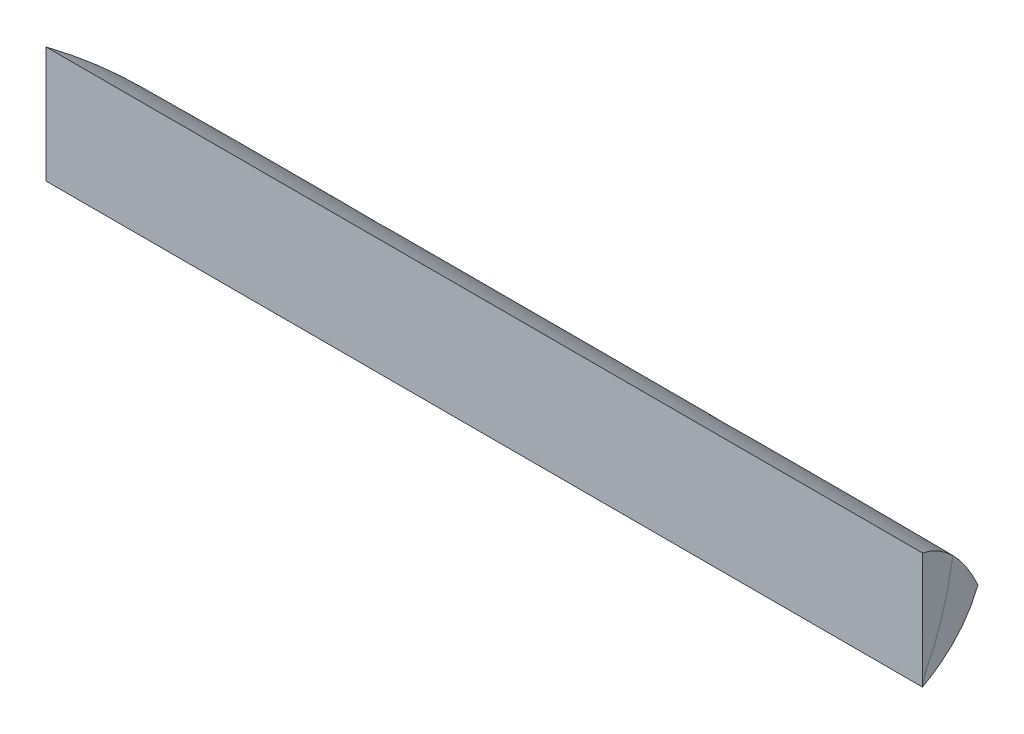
ISO-10303-21;
HEADER;
FILE_DESCRIPTION(('STEP AP214'),'2;1');
FILE_NAME('part.step','',(''),(''),'','','');
FILE_SCHEMA(('AUTOMOTIVE_DESIGN { 1 0 10303 214 1 1 1 1 }'));
ENDSEC;
DATA;
#1=APPLICATION_CONTEXT('core data for automotive mechanical design processes');
#2=APPLICATION_PROTOCOL_DEFINITION('international standard','automotive_design',2000,#1);
#3=PRODUCT_CONTEXT('',#1,'mechanical');
#4=PRODUCT('Part','Part','',(#3));
#5=PRODUCT_RELATED_PRODUCT_CATEGORY('part','',(#4));
#6=PRODUCT_DEFINITION_FORMATION('','',#4);
#7=PRODUCT_DEFINITION_CONTEXT('part definition',#1,'design');
#8=PRODUCT_DEFINITION('design','',#6,#7);
#9=PRODUCT_DEFINITION_SHAPE('','',#8);
#10=(LENGTH_UNIT() NAMED_UNIT(*) SI_UNIT(.MILLI.,.METRE.));
#11=(NAMED_UNIT(*) PLANE_ANGLE_UNIT() SI_UNIT($,.RADIAN.));
#12=(NAMED_UNIT(*) SI_UNIT($,.STERADIAN.) SOLID_ANGLE_UNIT());
#13=UNCERTAINTY_MEASURE_WITH_UNIT(LENGTH_MEASURE(1.E-05),#10,'distance_accuracy_value','');
#14=(GEOMETRIC_REPRESENTATION_CONTEXT(3) GLOBAL_UNCERTAINTY_ASSIGNED_CONTEXT((#13)) GLOBAL_UNIT_ASSIGNED_CONTEXT((#10,
#11,#12)) REPRESENTATION_CONTEXT('',''));
#15=CARTESIAN_POINT('',(0.,0.,0.));
#16=DIRECTION('',(0.,0.,1.));
#17=DIRECTION('',(1.,0.,0.));
#18=AXIS2_PLACEMENT_3D('',#15,#16,#17);
#19=CARTESIAN_POINT('',(-40.,450.,-33.));
#20=DIRECTION('',(0.,0.,1.));
#21=DIRECTION('',(1.,0.,0.));
#22=AXIS2_PLACEMENT_3D('',#19,#20,#21);
#23=PLANE('',#22);
#24=DIRECTION('',(1.,0.,0.));
#25=VECTOR('',#24,1.);
#26=CARTESIAN_POINT('',(-40.,53.,-33.));
#27=LINE('',#26,#25);
#28=CARTESIAN_POINT('',(-11.3137084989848,53.,-33.));
#29=VERTEX_POINT('',#28);
#30=CARTESIAN_POINT('',(11.3137084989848,53.,-33.));
#31=VERTEX_POINT('',#30);
#32=EDGE_CURVE('E152',#29,#31,#27,.T.);
#33=ORIENTED_EDGE('',*,*,#32,.F.);
#34=DIRECTION('',(0.,1.,0.));
#35=VECTOR('',#34,1.);
#36=CARTESIAN_POINT('',(-11.3137084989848,450.,-33.));
#37=LINE('',#36,#35);
#38=CARTESIAN_POINT('',(-11.3137084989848,50.,-33.));
#39=VERTEX_POINT('',#38);
#40=EDGE_CURVE('E153',#29,#39,#37,.F.);
#41=ORIENTED_EDGE('',*,*,#40,.T.);
#42=DIRECTION('',(-1.,0.,0.));
#43=VECTOR('',#42,1.);
#44=CARTESIAN_POINT('',(-40.,50.,-33.));
#45=LINE('',#44,#43);
#46=CARTESIAN_POINT('',(11.3137084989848,50.,-33.));
#47=VERTEX_POINT('',#46);
#48=EDGE_CURVE('E237',#47,#39,#45,.T.);
#49=ORIENTED_EDGE('',*,*,#48,.F.);
#50=DIRECTION('',(0.,1.,0.));
#51=VECTOR('',#50,1.);
#52=CARTESIAN_POINT('',(11.3137084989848,450.,-33.));
#53=LINE('',#52,#51);
#54=EDGE_CURVE('E155',#31,#47,#53,.F.);
#55=ORIENTED_EDGE('',*,*,#54,.F.);
#56=EDGE_LOOP('',(#33,#41,#49,#55));
#57=FACE_BOUND('',#56,.T.);
#58=ADVANCED_FACE('F98',(#57),#23,.T.);
#59=CARTESIAN_POINT('',(-11.3137084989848,53.,-33.));
#60=CARTESIAN_POINT('',(-11.3137084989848,52.6666666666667,-33.));
#61=CARTESIAN_POINT('',(-11.3137084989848,52.,-33.));
#62=CARTESIAN_POINT('',(-11.3137084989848,51.,-33.));
#63=CARTESIAN_POINT('',(-11.3137084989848,50.3333333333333,-33.));
#64=CARTESIAN_POINT('',(-11.3137084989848,50.,-33.));
#65=CARTESIAN_POINT('',(-11.005820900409,52.6323322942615,-33.5894788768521));
#66=CARTESIAN_POINT('',(-11.0422669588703,52.3541036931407,-33.5387314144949));
#67=CARTESIAN_POINT('',(-11.1102430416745,51.7976464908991,-33.4339607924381));
#68=CARTESIAN_POINT('',(-11.1968779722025,50.9629606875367,-33.2680903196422));
#69=CARTESIAN_POINT('',(-11.244027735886,50.4065034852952,-33.1524420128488));
#70=CARTESIAN_POINT('',(-11.2648540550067,50.1282748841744,-33.0935362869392));
#71=CARTESIAN_POINT('',(-10.7178235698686,52.1931962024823,-34.1408760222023));
#72=CARTESIAN_POINT('',(-10.7910126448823,51.9705213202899,-34.0389676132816));
#73=CARTESIAN_POINT('',(-10.9275186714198,51.5251715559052,-33.8285727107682));
#74=CARTESIAN_POINT('',(-11.1014944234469,50.8571469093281,-33.4954802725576));
#75=CARTESIAN_POINT('',(-11.1961781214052,50.4117971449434,-33.2632413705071));
#76=CARTESIAN_POINT('',(-11.2380004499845,50.189122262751,-33.1449499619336));
#77=CARTESIAN_POINT('',(-10.4534794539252,51.6870852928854,-34.6469869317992));
#78=CARTESIAN_POINT('',(-10.563712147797,51.5204186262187,-34.4934990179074));
#79=CARTESIAN_POINT('',(-10.7693087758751,51.1870852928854,-34.1766157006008));
#80=CARTESIAN_POINT('',(-11.031339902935,50.6870852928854,-33.6749332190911));
#81=CARTESIAN_POINT('',(-11.1739464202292,50.3537519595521,-33.325149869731));
#82=CARTESIAN_POINT('',(-11.2369365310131,50.1870852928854,-33.1469869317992));
#83=(BOUNDED_SURFACE() B_SPLINE_SURFACE(3,3,((#59,#60,#61,#62,#63,#64),(#65,#66,#67,#68,#69,
#70),(#71,#72,#73,#74,#75,#76),(#77,#78,#79,#80,#81,#82)),.UNSPECIFIED.,.F.,.F.,
.F.) B_SPLINE_SURFACE_WITH_KNOTS((4,4),(4,1,1,4),(0.,0.5),(0.,0.333333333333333,
0.666666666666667,1.),
.UNSPECIFIED.) GEOMETRIC_REPRESENTATION_ITEM() RATIONAL_B_SPLINE_SURFACE(((1.,1.,1.,1.,1.,1.),
(0.99195050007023,0.99195050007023,0.99195050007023,0.99195050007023,0.99195050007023,
0.99195050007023),(0.987925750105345,0.987925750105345,0.987925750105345,0.987925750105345,
0.987925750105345,0.987925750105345),(0.987925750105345,0.987925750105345,0.987925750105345,
0.987925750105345,0.987925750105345,0.987925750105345))) REPRESENTATION_ITEM('') SURFACE());
#84=CARTESIAN_POINT('',(-13.6326404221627,43.9398010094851,-28.5601934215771));
#85=DIRECTION('',(0.886379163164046,0.,0.462960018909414));
#86=DIRECTION('',(0.462960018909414,0.,-0.886379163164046));
#87=AXIS2_PLACEMENT_3D('',#84,#85,#86);
#88=CIRCLE('',#87,10.3526099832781);
#89=CARTESIAN_POINT('',(-10.4534794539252,51.6870852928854,-34.6469869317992));
#90=VERTEX_POINT('',#89);
#91=EDGE_CURVE('E119',#90,#29,#88,.T.);
#92=CARTESIAN_POINT('',(-10.4534794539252,51.6870852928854,-34.6469869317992));
#93=CARTESIAN_POINT('',(-10.563712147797,51.5204186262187,-34.4934990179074));
#94=CARTESIAN_POINT('',(-10.7693087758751,51.1870852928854,-34.1766157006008));
#95=CARTESIAN_POINT('',(-11.031339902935,50.6870852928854,-33.6749332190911));
#96=CARTESIAN_POINT('',(-11.1739464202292,50.3537519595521,-33.325149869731));
#97=CARTESIAN_POINT('',(-11.2369365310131,50.1870852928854,-33.1469869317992));
#98=(BOUNDED_CURVE() B_SPLINE_CURVE(3,(#92,#93,#94,#95,#96,#97),.UNSPECIFIED.,.F.,
.F.) B_SPLINE_CURVE_WITH_KNOTS((4,1,1,4),(0.,0.333333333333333,0.666666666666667,1.),
.UNSPECIFIED.) CURVE() GEOMETRIC_REPRESENTATION_ITEM() RATIONAL_B_SPLINE_CURVE((0.987925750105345,
0.987925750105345,0.987925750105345,0.987925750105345,0.987925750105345,0.987925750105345)) REPRESENTATION_ITEM(''));
#99=CARTESIAN_POINT('',(-11.2369365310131,50.1870852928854,-33.1469869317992));
#100=VERTEX_POINT('',#99);
#101=EDGE_CURVE('E164',#90,#100,#98,.T.);
#102=CARTESIAN_POINT('',(-11.2369365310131,50.1870852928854,-33.1469869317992));
#103=CARTESIAN_POINT('',(-11.2380004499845,50.189122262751,-33.1449499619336));
#104=CARTESIAN_POINT('',(-11.2648540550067,50.1282748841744,-33.0935362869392));
#105=CARTESIAN_POINT('',(-11.3137084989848,50.,-33.));
#106=(BOUNDED_CURVE() B_SPLINE_CURVE(3,(#102,#103,#104,#105),.UNSPECIFIED.,.F.,
.F.) B_SPLINE_CURVE_WITH_KNOTS((4,4),(0.,0.5),
.UNSPECIFIED.) CURVE() GEOMETRIC_REPRESENTATION_ITEM() RATIONAL_B_SPLINE_CURVE((0.987925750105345,
0.987925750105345,0.99195050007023,1.)) REPRESENTATION_ITEM(''));
#107=EDGE_CURVE('E162',#100,#39,#106,.T.);
#108=ORIENTED_EDGE('',*,*,#91,.F.);
#109=ORIENTED_EDGE('',*,*,#101,.T.);
#110=ORIENTED_EDGE('',*,*,#107,.T.);
#111=ORIENTED_EDGE('',*,*,#40,.F.);
#112=EDGE_LOOP('',(#108,#109,#110,#111));
#113=FACE_BOUND('',#112,.T.);
#114=ADVANCED_FACE('F161',(#113),#83,.T.);
#115=CARTESIAN_POINT('',(-10.4534794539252,51.6870852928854,-34.6469869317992));
#116=CARTESIAN_POINT('',(-10.563712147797,51.5204186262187,-34.4934990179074));
#117=CARTESIAN_POINT('',(-10.7693087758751,51.1870852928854,-34.1766157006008));
#118=CARTESIAN_POINT('',(-11.031339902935,50.6870852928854,-33.6749332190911));
#119=CARTESIAN_POINT('',(-11.1739464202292,50.3537519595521,-33.325149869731));
#120=CARTESIAN_POINT('',(-11.2369365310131,50.1870852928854,-33.1469869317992));
#121=CARTESIAN_POINT('',(-10.1891353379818,51.1809743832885,-35.1530978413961));
#122=CARTESIAN_POINT('',(-10.3364116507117,51.0703159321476,-34.9480304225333));
#123=CARTESIAN_POINT('',(-10.6110988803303,50.8489990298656,-34.5246586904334));
#124=CARTESIAN_POINT('',(-10.9611853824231,50.5170236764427,-33.8543861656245));
#125=CARTESIAN_POINT('',(-11.1517147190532,50.2957067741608,-33.3870583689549));
#126=CARTESIAN_POINT('',(-11.2358726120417,50.1850483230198,-33.1490239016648));
#127=CARTESIAN_POINT('',(-9.95273464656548,50.6161026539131,-35.6057085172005));
#128=CARTESIAN_POINT('',(-10.1367539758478,50.5609979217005,-35.3494801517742));
#129=CARTESIAN_POINT('',(-10.4799711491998,50.4507884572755,-34.8204841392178));
#130=CARTESIAN_POINT('',(-10.9173984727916,50.2854742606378,-33.9829896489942));
#131=CARTESIAN_POINT('',(-11.1554617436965,50.1752647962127,-33.3990712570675));
#132=CARTESIAN_POINT('',(-11.2606156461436,50.1201600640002,-33.1016511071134));
#133=CARTESIAN_POINT('',(-9.74679434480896,50.,-36.));
#134=CARTESIAN_POINT('',(-9.96725973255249,50.,-35.6930241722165));
#135=CARTESIAN_POINT('',(-10.3784529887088,50.,-35.0592575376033));
#136=CARTESIAN_POINT('',(-10.9025152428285,50.,-34.0558925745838));
#137=CARTESIAN_POINT('',(-11.187728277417,50.,-33.3563258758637));
#138=CARTESIAN_POINT('',(-11.3137084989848,50.,-33.));
#139=(BOUNDED_SURFACE() B_SPLINE_SURFACE(3,3,((#115,#116,#117,#118,#119,#120),(#121,#122,#123,
#124,#125,#126),(#127,#128,#129,#130,#131,#132),(#133,#134,#135,#136,#137,#138)),.UNSPECIFIED.,
.F.,.F.,.F.) B_SPLINE_SURFACE_WITH_KNOTS((4,4),(4,1,1,4),(0.5,1.),(0.,0.333333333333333,
0.666666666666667,1.),
.UNSPECIFIED.) GEOMETRIC_REPRESENTATION_ITEM() RATIONAL_B_SPLINE_SURFACE(((0.987925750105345,
0.987925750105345,0.987925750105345,0.987925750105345,0.987925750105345,0.987925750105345),
(0.987925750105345,0.987925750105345,0.987925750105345,0.987925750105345,0.987925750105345,
0.987925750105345),(0.99195050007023,0.99195050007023,0.99195050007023,0.99195050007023,
0.99195050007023,0.99195050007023),(1.,1.,1.,1.,1.,1.))) REPRESENTATION_ITEM('') SURFACE());
#140=CARTESIAN_POINT('',(-13.6326404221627,43.9398010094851,-28.5601934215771));
#141=DIRECTION('',(0.886379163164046,0.,0.462960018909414));
#142=DIRECTION('',(0.462960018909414,0.,-0.886379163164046));
#143=AXIS2_PLACEMENT_3D('',#140,#141,#142);
#144=CIRCLE('',#143,10.3526099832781);
#145=CARTESIAN_POINT('',(-9.74679434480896,50.,-36.));
#146=VERTEX_POINT('',#145);
#147=EDGE_CURVE('E146',#146,#90,#144,.T.);
#148=CARTESIAN_POINT('',(-9.74679434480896,50.,-36.));
#149=CARTESIAN_POINT('',(-9.85823939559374,50.,-35.8448304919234));
#150=CARTESIAN_POINT('',(-9.96597272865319,50.,-35.6869948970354));
#151=CARTESIAN_POINT('',(-10.1737812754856,50.,-35.3663658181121));
#152=CARTESIAN_POINT('',(-10.2738566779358,50.,-35.2035724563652));
#153=CARTESIAN_POINT('',(-10.463909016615,50.,-34.8771917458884));
#154=CARTESIAN_POINT('',(-10.5540652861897,50.,-34.7137087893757));
#155=CARTESIAN_POINT('',(-10.7266549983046,50.,-34.3827162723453));
#156=CARTESIAN_POINT('',(-10.8090884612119,50.,-34.2152067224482));
#157=CARTESIAN_POINT('',(-10.9667452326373,50.,-33.8750283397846));
#158=CARTESIAN_POINT('',(-11.0418984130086,50.,-33.702327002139));
#159=CARTESIAN_POINT('',(-11.1839990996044,50.,-33.3535770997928));
#160=CARTESIAN_POINT('',(-11.2509464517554,50.,-33.1775284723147));
#161=CARTESIAN_POINT('',(-11.3137084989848,50.,-33.));
#162=B_SPLINE_CURVE_WITH_KNOTS('',3,(#148,#149,#150,#151,#152,#153,#154,#155,#156,#157,#158,
#159,#160,#161),.UNSPECIFIED.,.F.,.F.,(4,2,2,2,2,2,4),(0.,0.57307642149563,1.14613871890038,
1.7060196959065,2.26589919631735,2.83072470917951,3.39556082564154),.UNSPECIFIED.);
#163=EDGE_CURVE('E228',#146,#39,#162,.T.);
#164=ORIENTED_EDGE('',*,*,#147,.F.);
#165=ORIENTED_EDGE('',*,*,#163,.T.);
#166=ORIENTED_EDGE('',*,*,#107,.F.);
#167=ORIENTED_EDGE('',*,*,#101,.F.);
#168=EDGE_LOOP('',(#164,#165,#166,#167));
#169=FACE_BOUND('',#168,.T.);
#170=ADVANCED_FACE('F266',(#169),#139,.T.);
#171=CARTESIAN_POINT('',(0.,50.,-29.));
#172=DIRECTION('',(0.,1.,0.));
#173=DIRECTION('',(0.,0.,1.));
#174=AXIS2_PLACEMENT_3D('',#171,#172,#173);
#175=PLANE('',#174);
#176=DIRECTION('',(1.,0.,0.));
#177=VECTOR('',#176,1.);
#178=CARTESIAN_POINT('',(0.,50.,-36.));
#179=LINE('',#178,#177);
#180=CARTESIAN_POINT('',(9.74679434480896,50.,-36.));
#181=VERTEX_POINT('',#180);
#182=EDGE_CURVE('E166',#181,#146,#179,.F.);
#183=ORIENTED_EDGE('',*,*,#182,.F.);
#184=CARTESIAN_POINT('',(9.74679434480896,50.,-36.));
#185=CARTESIAN_POINT('',(9.85823939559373,50.,-35.8448304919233));
#186=CARTESIAN_POINT('',(9.96597272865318,50.,-35.6869948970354));
#187=CARTESIAN_POINT('',(10.1737812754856,50.,-35.3663658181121));
#188=CARTESIAN_POINT('',(10.2738566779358,50.,-35.2035724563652));
#189=CARTESIAN_POINT('',(10.463909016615,50.,-34.8771917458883));
#190=CARTESIAN_POINT('',(10.5540652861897,50.,-34.7137087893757));
#191=CARTESIAN_POINT('',(10.7266549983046,50.,-34.3827162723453));
#192=CARTESIAN_POINT('',(10.8090884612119,50.,-34.2152067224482));
#193=CARTESIAN_POINT('',(10.9667452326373,50.,-33.8750283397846));
#194=CARTESIAN_POINT('',(11.0418984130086,50.,-33.702327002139));
#195=CARTESIAN_POINT('',(11.1839990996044,50.,-33.3535770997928));
#196=CARTESIAN_POINT('',(11.2509464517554,50.,-33.1775284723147));
#197=CARTESIAN_POINT('',(11.3137084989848,50.,-33.));
#198=B_SPLINE_CURVE_WITH_KNOTS('',3,(#184,#185,#186,#187,#188,#189,#190,#191,#192,#193,#194,
#195,#196,#197),.UNSPECIFIED.,.F.,.F.,(4,2,2,2,2,2,4),(0.,0.573076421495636,1.14613871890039,
1.70601969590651,2.26589919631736,2.83072470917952,3.39556082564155),.UNSPECIFIED.);
#199=EDGE_CURVE('E159',#181,#47,#198,.T.);
#200=ORIENTED_EDGE('',*,*,#199,.T.);
#201=ORIENTED_EDGE('',*,*,#48,.T.);
#202=ORIENTED_EDGE('',*,*,#163,.F.);
#203=EDGE_LOOP('',(#183,#200,#201,#202));
#204=FACE_BOUND('',#203,.T.);
#205=ADVANCED_FACE('F186',(#204),#175,.F.);
#206=CARTESIAN_POINT('',(11.3137084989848,53.,-33.));
#207=CARTESIAN_POINT('',(11.3137084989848,52.6666666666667,-33.));
#208=CARTESIAN_POINT('',(11.3137084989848,52.,-33.));
#209=CARTESIAN_POINT('',(11.3137084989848,51.,-33.));
#210=CARTESIAN_POINT('',(11.3137084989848,50.3333333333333,-33.));
#211=CARTESIAN_POINT('',(11.3137084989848,50.,-33.));
#212=CARTESIAN_POINT('',(11.005820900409,52.6323322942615,-33.5894788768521));
#213=CARTESIAN_POINT('',(11.0422669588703,52.3541036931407,-33.5387314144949));
#214=CARTESIAN_POINT('',(11.1102430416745,51.7976464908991,-33.4339607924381));
#215=CARTESIAN_POINT('',(11.1968779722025,50.9629606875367,-33.2680903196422));
#216=CARTESIAN_POINT('',(11.244027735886,50.4065034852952,-33.1524420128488));
#217=CARTESIAN_POINT('',(11.2648540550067,50.1282748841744,-33.0935362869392));
#218=CARTESIAN_POINT('',(10.7178235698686,52.1931962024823,-34.1408760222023));
#219=CARTESIAN_POINT('',(10.7910126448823,51.9705213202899,-34.0389676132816));
#220=CARTESIAN_POINT('',(10.9275186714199,51.5251715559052,-33.8285727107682));
#221=CARTESIAN_POINT('',(11.1014944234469,50.8571469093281,-33.4954802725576));
#222=CARTESIAN_POINT('',(11.1961781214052,50.4117971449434,-33.2632413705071));
#223=CARTESIAN_POINT('',(11.2380004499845,50.189122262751,-33.1449499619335));
#224=CARTESIAN_POINT('',(10.4534794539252,51.6870852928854,-34.6469869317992));
#225=CARTESIAN_POINT('',(10.563712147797,51.5204186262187,-34.4934990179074));
#226=CARTESIAN_POINT('',(10.7693087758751,51.1870852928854,-34.1766157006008));
#227=CARTESIAN_POINT('',(11.031339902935,50.6870852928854,-33.6749332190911));
#228=CARTESIAN_POINT('',(11.1739464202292,50.3537519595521,-33.325149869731));
#229=CARTESIAN_POINT('',(11.2369365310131,50.1870852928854,-33.1469869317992));
#230=(BOUNDED_SURFACE() B_SPLINE_SURFACE(3,3,((#206,#207,#208,#209,#210,#211),(#212,#213,#214,
#215,#216,#217),(#218,#219,#220,#221,#222,#223),(#224,#225,#226,#227,#228,#229)),.UNSPECIFIED.,
.F.,.F.,.F.) B_SPLINE_SURFACE_WITH_KNOTS((4,4),(4,1,1,4),(0.,0.5),(0.,0.333333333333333,
0.666666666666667,1.),
.UNSPECIFIED.) GEOMETRIC_REPRESENTATION_ITEM() RATIONAL_B_SPLINE_SURFACE(((1.,1.,1.,1.,1.,1.),
(0.99195050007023,0.99195050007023,0.99195050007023,0.99195050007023,0.99195050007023,
0.99195050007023),(0.987925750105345,0.987925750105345,0.987925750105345,0.987925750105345,
0.987925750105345,0.987925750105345),(0.987925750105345,0.987925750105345,0.987925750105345,
0.987925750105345,0.987925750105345,0.987925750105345))) REPRESENTATION_ITEM('') SURFACE());
#231=CARTESIAN_POINT('',(13.6326404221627,43.9398010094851,-28.5601934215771));
#232=DIRECTION('',(-0.886379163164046,0.,0.462960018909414));
#233=DIRECTION('',(0.462960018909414,0.,0.886379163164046));
#234=AXIS2_PLACEMENT_3D('',#231,#232,#233);
#235=CIRCLE('',#234,10.3526099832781);
#236=CARTESIAN_POINT('',(10.4534794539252,51.6870852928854,-34.6469869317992));
#237=VERTEX_POINT('',#236);
#238=EDGE_CURVE('E110',#31,#237,#235,.T.);
#239=CARTESIAN_POINT('',(11.2369365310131,50.1870852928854,-33.1469869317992));
#240=CARTESIAN_POINT('',(11.2358726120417,50.1850483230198,-33.1490239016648));
#241=CARTESIAN_POINT('',(11.2606156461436,50.1201600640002,-33.1016511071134));
#242=CARTESIAN_POINT('',(11.3137084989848,50.,-33.));
#243=(BOUNDED_CURVE() B_SPLINE_CURVE(3,(#239,#240,#241,#242),.UNSPECIFIED.,.F.,
.F.) B_SPLINE_CURVE_WITH_KNOTS((4,4),(0.5,1.),
.UNSPECIFIED.) CURVE() GEOMETRIC_REPRESENTATION_ITEM() RATIONAL_B_SPLINE_CURVE((0.987925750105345,
0.987925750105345,0.99195050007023,1.)) REPRESENTATION_ITEM(''));
#244=CARTESIAN_POINT('',(11.2369365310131,50.1870852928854,-33.1469869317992));
#245=VERTEX_POINT('',#244);
#246=EDGE_CURVE('E225',#245,#47,#243,.T.);
#247=CARTESIAN_POINT('',(10.4534794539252,51.6870852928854,-34.6469869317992));
#248=CARTESIAN_POINT('',(10.563712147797,51.5204186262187,-34.4934990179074));
#249=CARTESIAN_POINT('',(10.7693087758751,51.1870852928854,-34.1766157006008));
#250=CARTESIAN_POINT('',(11.031339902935,50.6870852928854,-33.6749332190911));
#251=CARTESIAN_POINT('',(11.1739464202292,50.3537519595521,-33.325149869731));
#252=CARTESIAN_POINT('',(11.2369365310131,50.1870852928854,-33.1469869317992));
#253=(BOUNDED_CURVE() B_SPLINE_CURVE(3,(#247,#248,#249,#250,#251,#252),.UNSPECIFIED.,.F.,
.F.) B_SPLINE_CURVE_WITH_KNOTS((4,1,1,4),(0.,0.333333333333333,0.666666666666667,1.),
.UNSPECIFIED.) CURVE() GEOMETRIC_REPRESENTATION_ITEM() RATIONAL_B_SPLINE_CURVE((0.987925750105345,
0.987925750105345,0.987925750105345,0.987925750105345,0.987925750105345,0.987925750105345)) REPRESENTATION_ITEM(''));
#254=EDGE_CURVE('E178',#237,#245,#253,.T.);
#255=ORIENTED_EDGE('',*,*,#238,.F.);
#256=ORIENTED_EDGE('',*,*,#54,.T.);
#257=ORIENTED_EDGE('',*,*,#246,.F.);
#258=ORIENTED_EDGE('',*,*,#254,.F.);
#259=EDGE_LOOP('',(#255,#256,#257,#258));
#260=FACE_BOUND('',#259,.T.);
#261=ADVANCED_FACE('F195',(#260),#230,.F.);
#262=CARTESIAN_POINT('',(10.4534794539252,51.6870852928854,-34.6469869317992));
#263=CARTESIAN_POINT('',(10.563712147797,51.5204186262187,-34.4934990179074));
#264=CARTESIAN_POINT('',(10.7693087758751,51.1870852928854,-34.1766157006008));
#265=CARTESIAN_POINT('',(11.031339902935,50.6870852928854,-33.6749332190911));
#266=CARTESIAN_POINT('',(11.1739464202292,50.3537519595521,-33.325149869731));
#267=CARTESIAN_POINT('',(11.2369365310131,50.1870852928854,-33.1469869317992));
#268=CARTESIAN_POINT('',(10.1891353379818,51.1809743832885,-35.1530978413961));
#269=CARTESIAN_POINT('',(10.3364116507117,51.0703159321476,-34.9480304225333));
#270=CARTESIAN_POINT('',(10.6110988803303,50.8489990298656,-34.5246586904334));
#271=CARTESIAN_POINT('',(10.9611853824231,50.5170236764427,-33.8543861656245));
#272=CARTESIAN_POINT('',(11.1517147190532,50.2957067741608,-33.3870583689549));
#273=CARTESIAN_POINT('',(11.2358726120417,50.1850483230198,-33.1490239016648));
#274=CARTESIAN_POINT('',(9.95273464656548,50.6161026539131,-35.6057085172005));
#275=CARTESIAN_POINT('',(10.1367539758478,50.5609979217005,-35.3494801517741));
#276=CARTESIAN_POINT('',(10.4799711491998,50.4507884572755,-34.8204841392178));
#277=CARTESIAN_POINT('',(10.9173984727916,50.2854742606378,-33.9829896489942));
#278=CARTESIAN_POINT('',(11.1554617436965,50.1752647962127,-33.3990712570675));
#279=CARTESIAN_POINT('',(11.2606156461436,50.1201600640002,-33.1016511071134));
#280=CARTESIAN_POINT('',(9.74679434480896,50.,-36.));
#281=CARTESIAN_POINT('',(9.96725973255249,50.,-35.6930241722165));
#282=CARTESIAN_POINT('',(10.3784529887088,50.,-35.0592575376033));
#283=CARTESIAN_POINT('',(10.9025152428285,50.,-34.0558925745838));
#284=CARTESIAN_POINT('',(11.187728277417,50.,-33.3563258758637));
#285=CARTESIAN_POINT('',(11.3137084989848,50.,-33.));
#286=(BOUNDED_SURFACE() B_SPLINE_SURFACE(3,3,((#262,#263,#264,#265,#266,#267),(#268,#269,#270,
#271,#272,#273),(#274,#275,#276,#277,#278,#279),(#280,#281,#282,#283,#284,#285)),.UNSPECIFIED.,
.F.,.F.,.F.) B_SPLINE_SURFACE_WITH_KNOTS((4,4),(4,1,1,4),(0.5,1.),(0.,0.333333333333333,
0.666666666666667,1.),
.UNSPECIFIED.) GEOMETRIC_REPRESENTATION_ITEM() RATIONAL_B_SPLINE_SURFACE(((0.987925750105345,
0.987925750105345,0.987925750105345,0.987925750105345,0.987925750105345,0.987925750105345),
(0.987925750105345,0.987925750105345,0.987925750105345,0.987925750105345,0.987925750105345,
0.987925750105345),(0.99195050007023,0.99195050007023,0.99195050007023,0.99195050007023,
0.99195050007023,0.99195050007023),(1.,1.,1.,1.,1.,1.))) REPRESENTATION_ITEM('') SURFACE());
#287=CARTESIAN_POINT('',(13.6326404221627,43.9398010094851,-28.5601934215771));
#288=DIRECTION('',(-0.886379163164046,0.,0.462960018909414));
#289=DIRECTION('',(0.462960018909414,0.,0.886379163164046));
#290=AXIS2_PLACEMENT_3D('',#287,#288,#289);
#291=CIRCLE('',#290,10.3526099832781);
#292=EDGE_CURVE('E12',#237,#181,#291,.T.);
#293=ORIENTED_EDGE('',*,*,#292,.F.);
#294=ORIENTED_EDGE('',*,*,#254,.T.);
#295=ORIENTED_EDGE('',*,*,#246,.T.);
#296=ORIENTED_EDGE('',*,*,#199,.F.);
#297=EDGE_LOOP('',(#293,#294,#295,#296));
#298=FACE_BOUND('',#297,.T.);
#299=ADVANCED_FACE('F190',(#298),#286,.F.);
#300=CARTESIAN_POINT('',(11.3137084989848,53.,-33.));
#301=CARTESIAN_POINT('',(10.825603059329,53.,-33.));
#302=CARTESIAN_POINT('',(9.88279401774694,53.,-33.));
#303=CARTESIAN_POINT('',(8.30031166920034,53.,-33.));
#304=CARTESIAN_POINT('',(6.90279902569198,53.,-33.));
#305=CARTESIAN_POINT('',(5.33145062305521,53.,-33.));
#306=CARTESIAN_POINT('',(4.23707371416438,53.,-33.));
#307=CARTESIAN_POINT('',(3.29426467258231,53.,-33.));
#308=CARTESIAN_POINT('',(2.0371859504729,53.,-33.));
#309=CARTESIAN_POINT('',(0.,53.,-33.));
#310=CARTESIAN_POINT('',(-2.0371859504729,53.,-33.));
#311=CARTESIAN_POINT('',(-3.29426467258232,53.,-33.));
#312=CARTESIAN_POINT('',(-4.23707371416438,53.,-33.));
#313=CARTESIAN_POINT('',(-5.33145062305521,53.,-33.));
#314=CARTESIAN_POINT('',(-6.90279902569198,53.,-33.));
#315=CARTESIAN_POINT('',(-8.30031166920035,53.,-33.));
#316=CARTESIAN_POINT('',(-9.88279401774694,53.,-33.));
#317=CARTESIAN_POINT('',(-10.825603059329,53.,-33.));
#318=CARTESIAN_POINT('',(-11.3137084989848,53.,-33.));
#319=CARTESIAN_POINT('',(10.6928955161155,52.2586486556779,-34.1886030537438));
#320=CARTESIAN_POINT('',(10.2496537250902,52.2559088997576,-34.1970952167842));
#321=CARTESIAN_POINT('',(9.39264140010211,52.2506101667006,-34.2135191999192));
#322=CARTESIAN_POINT('',(7.92770218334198,52.244613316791,-34.2321070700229));
#323=CARTESIAN_POINT('',(6.59068856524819,52.2451219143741,-34.2305306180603));
#324=CARTESIAN_POINT('',(5.08300601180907,52.2464749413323,-34.2263367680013));
#325=CARTESIAN_POINT('',(4.03980250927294,52.2463744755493,-34.2266481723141));
#326=CARTESIAN_POINT('',(3.14171061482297,52.2461789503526,-34.2272542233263));
#327=CARTESIAN_POINT('',(1.94397287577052,52.2459501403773,-34.2279634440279));
#328=CARTESIAN_POINT('',(0.,52.2462307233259,-34.2270937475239));
#329=CARTESIAN_POINT('',(-1.94397287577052,52.2459501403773,-34.2279634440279));
#330=CARTESIAN_POINT('',(-3.14171061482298,52.2461789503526,-34.2272542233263));
#331=CARTESIAN_POINT('',(-4.03980250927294,52.2463744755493,-34.2266481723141));
#332=CARTESIAN_POINT('',(-5.08300601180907,52.2464749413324,-34.2263367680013));
#333=CARTESIAN_POINT('',(-6.59068856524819,52.2451219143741,-34.2305306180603));
#334=CARTESIAN_POINT('',(-7.92770218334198,52.244613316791,-34.2321070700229));
#335=CARTESIAN_POINT('',(-9.39264140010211,52.2506101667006,-34.2135191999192));
#336=CARTESIAN_POINT('',(-10.2496537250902,52.2559088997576,-34.1970952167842));
#337=CARTESIAN_POINT('',(-10.6928955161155,52.2586486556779,-34.1886030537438));
#338=CARTESIAN_POINT('',(10.1620446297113,51.2422862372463,-35.2049654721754));
#339=CARTESIAN_POINT('',(9.7429506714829,51.2390568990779,-35.213947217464));
#340=CARTESIAN_POINT('',(8.93286524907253,51.2328113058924,-35.2313180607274));
#341=CARTESIAN_POINT('',(7.54578920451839,51.2257428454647,-35.2509775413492));
#342=CARTESIAN_POINT('',(6.2728538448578,51.2263423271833,-35.249310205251));
#343=CARTESIAN_POINT('',(4.83656393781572,51.2279371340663,-35.2448745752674));
#344=CARTESIAN_POINT('',(3.84395533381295,51.2278187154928,-35.2452039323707));
#345=CARTESIAN_POINT('',(2.98955650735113,51.2275882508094,-35.2458449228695));
#346=CARTESIAN_POINT('',(1.85006118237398,51.2273185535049,-35.2465950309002));
#347=CARTESIAN_POINT('',(0.,51.2276492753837,-35.2456751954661));
#348=CARTESIAN_POINT('',(-1.85006118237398,51.2273185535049,-35.2465950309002));
#349=CARTESIAN_POINT('',(-2.98955650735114,51.2275882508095,-35.2458449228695));
#350=CARTESIAN_POINT('',(-3.84395533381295,51.2278187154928,-35.2452039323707));
#351=CARTESIAN_POINT('',(-4.83656393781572,51.2279371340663,-35.2448745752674));
#352=CARTESIAN_POINT('',(-6.2728538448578,51.2263423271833,-35.2493102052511));
#353=CARTESIAN_POINT('',(-7.5457892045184,51.2257428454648,-35.2509775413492));
#354=CARTESIAN_POINT('',(-8.93286524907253,51.2328113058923,-35.2313180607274));
#355=CARTESIAN_POINT('',(-9.7429506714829,51.2390568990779,-35.213947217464));
#356=CARTESIAN_POINT('',(-10.1620446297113,51.2422862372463,-35.2049654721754));
#357=CARTESIAN_POINT('',(9.74679434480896,50.,-36.));
#358=CARTESIAN_POINT('',(9.3262900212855,50.,-36.));
#359=CARTESIAN_POINT('',(8.51405715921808,50.,-36.));
#360=CARTESIAN_POINT('',(7.15074379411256,50.,-36.));
#361=CARTESIAN_POINT('',(5.94678239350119,50.,-36.));
#362=CARTESIAN_POINT('',(4.59306095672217,50.,-36.));
#363=CARTESIAN_POINT('',(3.65025191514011,50.,-36.));
#364=CARTESIAN_POINT('',(2.8380190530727,50.,-36.));
#365=CARTESIAN_POINT('',(1.75504190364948,50.,-36.));
#366=CARTESIAN_POINT('',(0.,50.,-36.));
#367=CARTESIAN_POINT('',(-1.75504190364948,50.,-36.));
#368=CARTESIAN_POINT('',(-2.8380190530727,50.,-36.));
#369=CARTESIAN_POINT('',(-3.65025191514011,50.,-36.));
#370=CARTESIAN_POINT('',(-4.59306095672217,50.,-36.));
#371=CARTESIAN_POINT('',(-5.94678239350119,50.,-36.));
#372=CARTESIAN_POINT('',(-7.15074379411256,50.,-36.));
#373=CARTESIAN_POINT('',(-8.51405715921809,50.,-36.));
#374=CARTESIAN_POINT('',(-9.3262900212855,50.,-36.));
#375=CARTESIAN_POINT('',(-9.74679434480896,50.,-36.));
#376=(BOUNDED_SURFACE() B_SPLINE_SURFACE(3,3,((#300,#301,#302,#303,#304,#305,#306,#307,#308,
#309,#310,#311,#312,#313,#314,#315,#316,#317,#318),(#319,#320,#321,#322,#323,#324,#325,#326,
#327,#328,#329,#330,#331,#332,#333,#334,#335,#336,#337),(#338,#339,#340,#341,#342,#343,#344,
#345,#346,#347,#348,#349,#350,#351,#352,#353,#354,#355,#356),(#357,#358,#359,#360,#361,#362,
#363,#364,#365,#366,#367,#368,#369,#370,#371,#372,#373,#374,#375)),.UNSPECIFIED.,.F.,.F.,
.F.) B_SPLINE_SURFACE_WITH_KNOTS((4,4),(4,1,1,1,1,1,1,1,1,1,1,1,1,1,1,1,4),(0.,1.),(0.,
0.0647142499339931,0.125,0.209809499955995,0.25,0.333333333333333,0.354904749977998,0.375,0.5,
0.625,0.645095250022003,0.666666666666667,0.75,0.790190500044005,0.875,0.935285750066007,1.),
.UNSPECIFIED.) GEOMETRIC_REPRESENTATION_ITEM() RATIONAL_B_SPLINE_SURFACE(((1.,1.,1.,1.,1.,1.,1.,
1.,1.,1.,1.,1.,1.,1.,1.,1.,1.,1.,1.),(0.98390100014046,0.98390100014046,0.983080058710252,
0.981292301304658,0.981443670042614,0.981846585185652,0.981816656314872,0.981758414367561,
0.981690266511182,0.981773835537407,0.981690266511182,0.981758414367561,0.981816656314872,
0.981846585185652,0.981443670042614,0.981292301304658,0.983080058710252,0.98390100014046,
0.98390100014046),(0.98390100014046,0.98390100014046,0.983080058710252,0.981292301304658,
0.981443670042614,0.981846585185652,0.981816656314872,0.981758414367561,0.981690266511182,
0.981773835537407,0.981690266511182,0.981758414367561,0.981816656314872,0.981846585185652,
0.981443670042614,0.981292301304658,0.983080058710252,0.98390100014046,0.98390100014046),(1.,1.,
1.,1.,1.,1.,1.,1.,1.,1.,1.,1.,1.,1.,1.,1.,1.,1.,1.))) REPRESENTATION_ITEM('') SURFACE());
#377=ORIENTED_EDGE('',*,*,#292,.T.);
#378=ORIENTED_EDGE('',*,*,#182,.T.);
#379=ORIENTED_EDGE('',*,*,#147,.T.);
#380=ORIENTED_EDGE('',*,*,#91,.T.);
#381=ORIENTED_EDGE('',*,*,#32,.T.);
#382=ORIENTED_EDGE('',*,*,#238,.T.);
#383=EDGE_LOOP('',(#377,#378,#379,#380,#381,#382));
#384=FACE_BOUND('',#383,.T.);
#385=ADVANCED_FACE('F100',(#384),#376,.T.);
#386=CLOSED_SHELL('',(#58,#114,#170,#205,#261,#299,#385));
#387=MANIFOLD_SOLID_BREP('B2',#386);
#388=ADVANCED_BREP_SHAPE_REPRESENTATION('',(#18,#387),#14);
#389=SHAPE_DEFINITION_REPRESENTATION(#9,#388);
ENDSEC;
END-ISO-10303-21;
